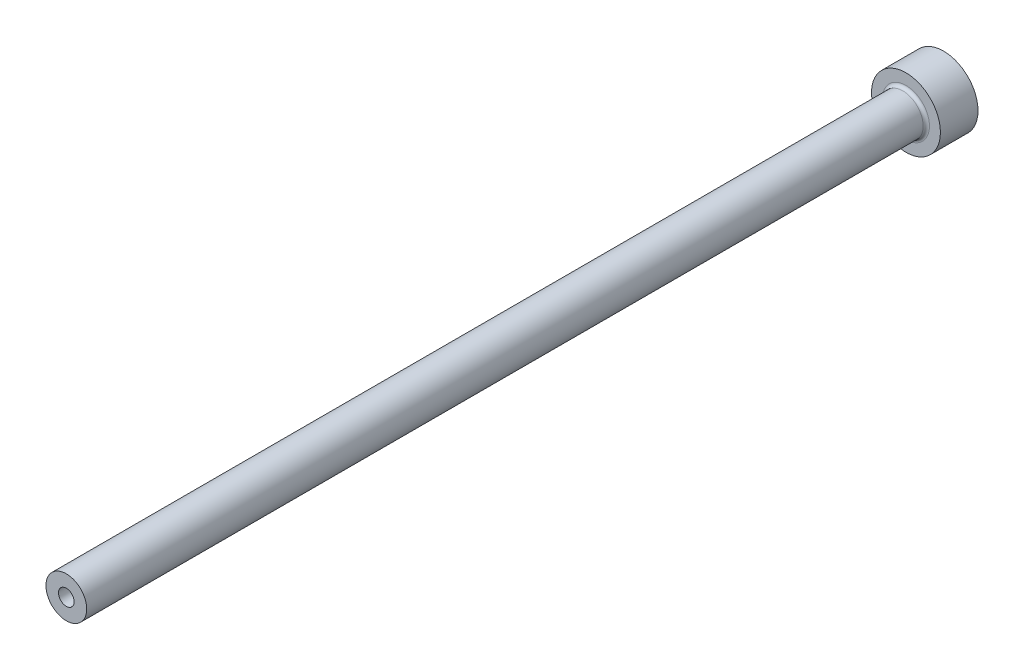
from build123d import *

# Parameters (mm, degrees)
HEAD_FILLET_R          = 0.5
ID_RELIEF_CHAMFER_SIZE = 0.5


with BuildPart() as part:
    # OD FV → Base Revolve (revolve)
    with BuildSketch(Plane(origin=(0, 0, 0), x_dir=(1, 0, 0), z_dir=(0, 1, 0))):
        Polygon((0, -140), (3.25, -140), (3.25, -6), (5.5, -6), (5.5, 0), (0, 0), align=None)
    revolve(axis=Axis((0, 0, 140), (0, 0, -1)))

    # ID FV → Hole (revolve, cut)
    with BuildSketch(Plane(origin=(0, 0, 0), x_dir=(1, 0, 0), z_dir=(0, 1, 0))):
        Polygon((0, -140), (1.25, -140), (1.25, -90), (1.5, -89.566987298), (1.5, 0), (0, 0), align=None)
    revolve(axis=Axis((0, 0, 140), (0, 0, -1)), mode=Mode.SUBTRACT)

    # Head Fillet
    head_fillet_edges = [part.edges().sort_by_distance(p)[0] for p in [
        (-3.25, 0, 6),
    ]]
    fillet(head_fillet_edges, radius=HEAD_FILLET_R)

    # ID Relief Chamfer
    id_relief_chamfer_edges = [part.edges().sort_by_distance(p)[0] for p in [
        (-1.5, 0, 0),
    ]]
    chamfer(id_relief_chamfer_edges, length=ID_RELIEF_CHAMFER_SIZE)


solid = part.part
